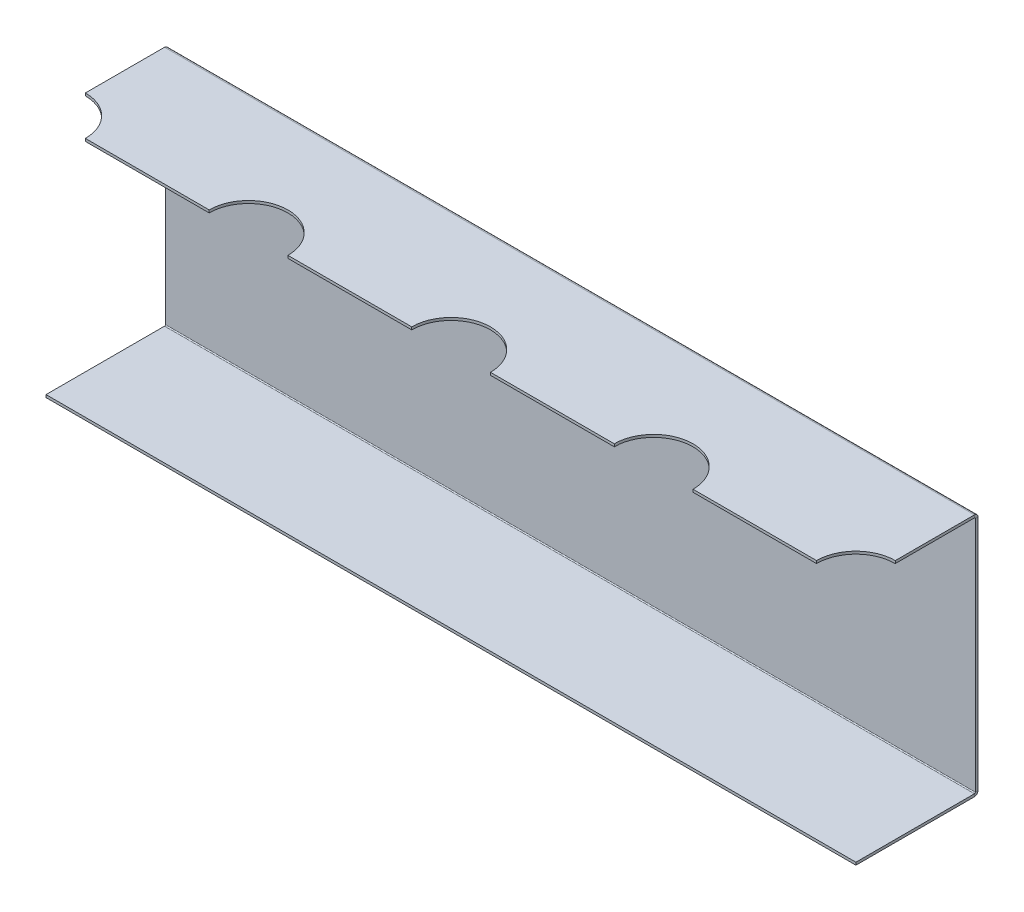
ISO-10303-21;
HEADER;
FILE_DESCRIPTION(('STEP AP214'),'2;1');
FILE_NAME('part.step','',(''),(''),'','','');
FILE_SCHEMA(('AUTOMOTIVE_DESIGN { 1 0 10303 214 1 1 1 1 }'));
ENDSEC;
DATA;
#1=APPLICATION_CONTEXT('core data for automotive mechanical design processes');
#2=APPLICATION_PROTOCOL_DEFINITION('international standard','automotive_design',2000,#1);
#3=PRODUCT_CONTEXT('',#1,'mechanical');
#4=PRODUCT('Part','Part','',(#3));
#5=PRODUCT_RELATED_PRODUCT_CATEGORY('part','',(#4));
#6=PRODUCT_DEFINITION_FORMATION('','',#4);
#7=PRODUCT_DEFINITION_CONTEXT('part definition',#1,'design');
#8=PRODUCT_DEFINITION('design','',#6,#7);
#9=PRODUCT_DEFINITION_SHAPE('','',#8);
#10=(LENGTH_UNIT() NAMED_UNIT(*) SI_UNIT(.MILLI.,.METRE.));
#11=(NAMED_UNIT(*) PLANE_ANGLE_UNIT() SI_UNIT($,.RADIAN.));
#12=(NAMED_UNIT(*) SI_UNIT($,.STERADIAN.) SOLID_ANGLE_UNIT());
#13=UNCERTAINTY_MEASURE_WITH_UNIT(LENGTH_MEASURE(1.E-05),#10,'distance_accuracy_value','');
#14=(GEOMETRIC_REPRESENTATION_CONTEXT(3) GLOBAL_UNCERTAINTY_ASSIGNED_CONTEXT((#13)) GLOBAL_UNIT_ASSIGNED_CONTEXT((#10,
#11,#12)) REPRESENTATION_CONTEXT('',''));
#15=CARTESIAN_POINT('',(0.,0.,0.));
#16=DIRECTION('',(0.,0.,1.));
#17=DIRECTION('',(1.,0.,0.));
#18=AXIS2_PLACEMENT_3D('',#15,#16,#17);
#19=CARTESIAN_POINT('',(308.5,93.0000000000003,93.));
#20=DIRECTION('',(0.,-1.,0.));
#21=DIRECTION('',(0.,0.,-1.));
#22=AXIS2_PLACEMENT_3D('',#19,#20,#21);
#23=PLANE('',#22);
#24=CARTESIAN_POINT('',(-308.5,93.0000000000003,93.));
#25=DIRECTION('',(0.,-1.,0.));
#26=DIRECTION('',(0.,0.,-1.));
#27=AXIS2_PLACEMENT_3D('',#24,#25,#26);
#28=CIRCLE('',#27,30.);
#29=CARTESIAN_POINT('',(-278.5,93.0000000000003,93.));
#30=VERTEX_POINT('',#29);
#31=CARTESIAN_POINT('',(-308.5,93.0000000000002,63.));
#32=VERTEX_POINT('',#31);
#33=EDGE_CURVE('E48',#30,#32,#28,.F.);
#34=ORIENTED_EDGE('',*,*,#33,.F.);
#35=DIRECTION('',(1.,0.,0.));
#36=VECTOR('',#35,1.);
#37=CARTESIAN_POINT('',(308.5,93.0000000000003,93.));
#38=LINE('',#37,#36);
#39=CARTESIAN_POINT('',(-184.2,93.0000000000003,93.));
#40=VERTEX_POINT('',#39);
#41=EDGE_CURVE('E179',#30,#40,#38,.T.);
#42=ORIENTED_EDGE('',*,*,#41,.T.);
#43=CARTESIAN_POINT('',(-154.2,93.0000000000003,93.));
#44=DIRECTION('',(0.,-1.,0.));
#45=DIRECTION('',(0.,0.,-1.));
#46=AXIS2_PLACEMENT_3D('',#43,#44,#45);
#47=CIRCLE('',#46,30.);
#48=CARTESIAN_POINT('',(-124.2,93.0000000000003,93.));
#49=VERTEX_POINT('',#48);
#50=EDGE_CURVE('E282',#49,#40,#47,.F.);
#51=ORIENTED_EDGE('',*,*,#50,.F.);
#52=CARTESIAN_POINT('',(-29.8999999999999,93.0000000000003,93.));
#53=VERTEX_POINT('',#52);
#54=EDGE_CURVE('E190',#49,#53,#38,.T.);
#55=ORIENTED_EDGE('',*,*,#54,.T.);
#56=CARTESIAN_POINT('',(0.100000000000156,93.0000000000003,93.));
#57=DIRECTION('',(0.,-1.,0.));
#58=DIRECTION('',(0.,0.,-1.));
#59=AXIS2_PLACEMENT_3D('',#56,#57,#58);
#60=CIRCLE('',#59,30.);
#61=CARTESIAN_POINT('',(30.1000000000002,93.0000000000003,93.));
#62=VERTEX_POINT('',#61);
#63=EDGE_CURVE('E292',#62,#53,#60,.F.);
#64=ORIENTED_EDGE('',*,*,#63,.F.);
#65=CARTESIAN_POINT('',(124.4,93.0000000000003,93.));
#66=VERTEX_POINT('',#65);
#67=EDGE_CURVE('E197',#62,#66,#38,.T.);
#68=ORIENTED_EDGE('',*,*,#67,.T.);
#69=CARTESIAN_POINT('',(154.4,93.0000000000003,93.));
#70=DIRECTION('',(0.,-1.,0.));
#71=DIRECTION('',(0.,0.,-1.));
#72=AXIS2_PLACEMENT_3D('',#69,#70,#71);
#73=CIRCLE('',#72,30.);
#74=CARTESIAN_POINT('',(184.4,93.0000000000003,93.));
#75=VERTEX_POINT('',#74);
#76=EDGE_CURVE('E302',#75,#66,#73,.F.);
#77=ORIENTED_EDGE('',*,*,#76,.F.);
#78=CARTESIAN_POINT('',(278.5,93.0000000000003,93.));
#79=VERTEX_POINT('',#78);
#80=EDGE_CURVE('E192',#75,#79,#38,.T.);
#81=ORIENTED_EDGE('',*,*,#80,.T.);
#82=CARTESIAN_POINT('',(308.5,93.0000000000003,93.));
#83=DIRECTION('',(0.,-1.,0.));
#84=DIRECTION('',(0.,0.,-1.));
#85=AXIS2_PLACEMENT_3D('',#82,#83,#84);
#86=CIRCLE('',#85,30.);
#87=CARTESIAN_POINT('',(308.5,93.0000000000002,63.));
#88=VERTEX_POINT('',#87);
#89=EDGE_CURVE('E312',#88,#79,#86,.F.);
#90=ORIENTED_EDGE('',*,*,#89,.F.);
#91=DIRECTION('',(0.,0.,-1.));
#92=VECTOR('',#91,1.);
#93=CARTESIAN_POINT('',(308.5,93.,1.99999999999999));
#94=LINE('',#93,#92);
#95=CARTESIAN_POINT('',(308.5,93.,2.73659999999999));
#96=VERTEX_POINT('',#95);
#97=EDGE_CURVE('E205',#88,#96,#94,.T.);
#98=ORIENTED_EDGE('',*,*,#97,.T.);
#99=DIRECTION('',(1.,0.,0.));
#100=VECTOR('',#99,1.);
#101=CARTESIAN_POINT('',(308.5,93.,2.73659999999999));
#102=LINE('',#101,#100);
#103=CARTESIAN_POINT('',(-308.5,93.,2.73659999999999));
#104=VERTEX_POINT('',#103);
#105=EDGE_CURVE('E217',#104,#96,#102,.T.);
#106=ORIENTED_EDGE('',*,*,#105,.F.);
#107=DIRECTION('',(0.,0.,1.));
#108=VECTOR('',#107,1.);
#109=CARTESIAN_POINT('',(-308.5,93.0000000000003,93.));
#110=LINE('',#109,#108);
#111=EDGE_CURVE('E183',#104,#32,#110,.T.);
#112=ORIENTED_EDGE('',*,*,#111,.T.);
#113=EDGE_LOOP('',(#34,#42,#51,#55,#64,#68,#77,#81,#90,#98,#106,#112));
#114=FACE_BOUND('',#113,.T.);
#115=ADVANCED_FACE('F33',(#114),#23,.F.);
#116=CARTESIAN_POINT('',(308.5,91.0000000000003,93.));
#117=DIRECTION('',(0.,-1.,0.));
#118=DIRECTION('',(0.,0.,-1.));
#119=AXIS2_PLACEMENT_3D('',#116,#117,#118);
#120=PLANE('',#119);
#121=DIRECTION('',(1.,0.,0.));
#122=VECTOR('',#121,1.);
#123=CARTESIAN_POINT('',(308.5,91.0000000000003,93.));
#124=LINE('',#123,#122);
#125=CARTESIAN_POINT('',(-278.5,91.0000000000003,93.));
#126=VERTEX_POINT('',#125);
#127=CARTESIAN_POINT('',(-184.2,91.0000000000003,93.));
#128=VERTEX_POINT('',#127);
#129=EDGE_CURVE('E206',#126,#128,#124,.T.);
#130=ORIENTED_EDGE('',*,*,#129,.F.);
#131=CARTESIAN_POINT('',(-308.5,91.0000000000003,93.));
#132=DIRECTION('',(0.,-1.,0.));
#133=DIRECTION('',(0.,0.,-1.));
#134=AXIS2_PLACEMENT_3D('',#131,#132,#133);
#135=CIRCLE('',#134,30.);
#136=CARTESIAN_POINT('',(-308.5,91.0000000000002,63.));
#137=VERTEX_POINT('',#136);
#138=EDGE_CURVE('E170',#126,#137,#135,.F.);
#139=ORIENTED_EDGE('',*,*,#138,.T.);
#140=DIRECTION('',(0.,0.,1.));
#141=VECTOR('',#140,1.);
#142=CARTESIAN_POINT('',(-308.5,91.0000000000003,93.));
#143=LINE('',#142,#141);
#144=CARTESIAN_POINT('',(-308.5,91.,2.7366));
#145=VERTEX_POINT('',#144);
#146=EDGE_CURVE('E212',#145,#137,#143,.T.);
#147=ORIENTED_EDGE('',*,*,#146,.F.);
#148=DIRECTION('',(-1.,0.,0.));
#149=VECTOR('',#148,1.);
#150=CARTESIAN_POINT('',(308.5,91.,2.73660000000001));
#151=LINE('',#150,#149);
#152=CARTESIAN_POINT('',(308.5,91.,2.7366));
#153=VERTEX_POINT('',#152);
#154=EDGE_CURVE('E224',#153,#145,#151,.T.);
#155=ORIENTED_EDGE('',*,*,#154,.F.);
#156=DIRECTION('',(0.,0.,-1.));
#157=VECTOR('',#156,1.);
#158=CARTESIAN_POINT('',(308.5,91.,2.));
#159=LINE('',#158,#157);
#160=CARTESIAN_POINT('',(308.5,91.0000000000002,63.));
#161=VERTEX_POINT('',#160);
#162=EDGE_CURVE('E215',#161,#153,#159,.T.);
#163=ORIENTED_EDGE('',*,*,#162,.F.);
#164=CARTESIAN_POINT('',(308.5,91.0000000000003,93.));
#165=DIRECTION('',(0.,-1.,0.));
#166=DIRECTION('',(0.,0.,-1.));
#167=AXIS2_PLACEMENT_3D('',#164,#165,#166);
#168=CIRCLE('',#167,30.);
#169=CARTESIAN_POINT('',(278.5,91.0000000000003,93.));
#170=VERTEX_POINT('',#169);
#171=EDGE_CURVE('E56',#161,#170,#168,.F.);
#172=ORIENTED_EDGE('',*,*,#171,.T.);
#173=CARTESIAN_POINT('',(184.4,91.0000000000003,93.));
#174=VERTEX_POINT('',#173);
#175=EDGE_CURVE('E211',#174,#170,#124,.T.);
#176=ORIENTED_EDGE('',*,*,#175,.F.);
#177=CARTESIAN_POINT('',(154.4,91.0000000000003,93.));
#178=DIRECTION('',(0.,-1.,0.));
#179=DIRECTION('',(0.,0.,-1.));
#180=AXIS2_PLACEMENT_3D('',#177,#178,#179);
#181=CIRCLE('',#180,30.);
#182=CARTESIAN_POINT('',(124.4,91.0000000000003,93.));
#183=VERTEX_POINT('',#182);
#184=EDGE_CURVE('E304',#174,#183,#181,.F.);
#185=ORIENTED_EDGE('',*,*,#184,.T.);
#186=CARTESIAN_POINT('',(30.1000000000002,91.0000000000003,93.));
#187=VERTEX_POINT('',#186);
#188=EDGE_CURVE('E640',#187,#183,#124,.T.);
#189=ORIENTED_EDGE('',*,*,#188,.F.);
#190=CARTESIAN_POINT('',(0.100000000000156,91.0000000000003,93.));
#191=DIRECTION('',(0.,-1.,0.));
#192=DIRECTION('',(0.,0.,-1.));
#193=AXIS2_PLACEMENT_3D('',#190,#191,#192);
#194=CIRCLE('',#193,30.);
#195=CARTESIAN_POINT('',(-29.8999999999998,91.0000000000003,93.));
#196=VERTEX_POINT('',#195);
#197=EDGE_CURVE('E294',#187,#196,#194,.F.);
#198=ORIENTED_EDGE('',*,*,#197,.T.);
#199=CARTESIAN_POINT('',(-124.2,91.0000000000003,93.));
#200=VERTEX_POINT('',#199);
#201=EDGE_CURVE('E210',#200,#196,#124,.T.);
#202=ORIENTED_EDGE('',*,*,#201,.F.);
#203=CARTESIAN_POINT('',(-154.2,91.0000000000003,93.));
#204=DIRECTION('',(0.,-1.,0.));
#205=DIRECTION('',(0.,0.,-1.));
#206=AXIS2_PLACEMENT_3D('',#203,#204,#205);
#207=CIRCLE('',#206,30.);
#208=EDGE_CURVE('E284',#200,#128,#207,.F.);
#209=ORIENTED_EDGE('',*,*,#208,.T.);
#210=EDGE_LOOP('',(#130,#139,#147,#155,#163,#172,#176,#185,#189,#198,#202,#209));
#211=FACE_BOUND('',#210,.T.);
#212=ADVANCED_FACE('F319',(#211),#120,.T.);
#213=CARTESIAN_POINT('',(308.5,93.0000000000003,93.));
#214=DIRECTION('',(0.,0.,-1.));
#215=DIRECTION('',(0.,1.,0.));
#216=AXIS2_PLACEMENT_3D('',#213,#214,#215);
#217=PLANE('',#216);
#218=DIRECTION('',(0.,-1.,0.));
#219=VECTOR('',#218,1.);
#220=CARTESIAN_POINT('',(-278.5,91.0000000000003,93.));
#221=LINE('',#220,#219);
#222=EDGE_CURVE('E167',#126,#30,#221,.F.);
#223=ORIENTED_EDGE('',*,*,#222,.F.);
#224=ORIENTED_EDGE('',*,*,#129,.T.);
#225=DIRECTION('',(0.,-1.,0.));
#226=VECTOR('',#225,1.);
#227=CARTESIAN_POINT('',(-184.2,91.0000000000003,93.));
#228=LINE('',#227,#226);
#229=EDGE_CURVE('E188',#128,#40,#228,.F.);
#230=ORIENTED_EDGE('',*,*,#229,.T.);
#231=ORIENTED_EDGE('',*,*,#41,.F.);
#232=EDGE_LOOP('',(#223,#224,#230,#231));
#233=FACE_BOUND('',#232,.T.);
#234=ADVANCED_FACE('F186',(#233),#217,.F.);
#235=CARTESIAN_POINT('',(-308.5,93.0000000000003,93.));
#236=DIRECTION('',(1.,0.,0.));
#237=DIRECTION('',(0.,0.,-1.));
#238=AXIS2_PLACEMENT_3D('',#235,#236,#237);
#239=PLANE('',#238);
#240=DIRECTION('',(0.,-1.,0.));
#241=VECTOR('',#240,1.);
#242=CARTESIAN_POINT('',(-308.5,91.0000000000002,63.));
#243=LINE('',#242,#241);
#244=EDGE_CURVE('E174',#137,#32,#243,.F.);
#245=ORIENTED_EDGE('',*,*,#244,.T.);
#246=ORIENTED_EDGE('',*,*,#111,.F.);
#247=DIRECTION('',(0.,1.,0.));
#248=VECTOR('',#247,1.);
#249=CARTESIAN_POINT('',(-308.5,91.,2.73659999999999));
#250=LINE('',#249,#248);
#251=EDGE_CURVE('E220',#145,#104,#250,.T.);
#252=ORIENTED_EDGE('',*,*,#251,.F.);
#253=ORIENTED_EDGE('',*,*,#146,.T.);
#254=EDGE_LOOP('',(#245,#246,#252,#253));
#255=FACE_BOUND('',#254,.T.);
#256=ADVANCED_FACE('F323',(#255),#239,.F.);
#257=DIRECTION('',(0.,-1.,0.));
#258=VECTOR('',#257,1.);
#259=CARTESIAN_POINT('',(278.5,91.0000000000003,93.));
#260=LINE('',#259,#258);
#261=EDGE_CURVE('E309',#170,#79,#260,.F.);
#262=ORIENTED_EDGE('',*,*,#261,.T.);
#263=ORIENTED_EDGE('',*,*,#80,.F.);
#264=DIRECTION('',(0.,-1.,0.));
#265=VECTOR('',#264,1.);
#266=CARTESIAN_POINT('',(184.4,91.0000000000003,93.));
#267=LINE('',#266,#265);
#268=EDGE_CURVE('E297',#174,#75,#267,.F.);
#269=ORIENTED_EDGE('',*,*,#268,.F.);
#270=ORIENTED_EDGE('',*,*,#175,.T.);
#271=EDGE_LOOP('',(#262,#263,#269,#270));
#272=FACE_BOUND('',#271,.T.);
#273=ADVANCED_FACE('F422',(#272),#217,.F.);
#274=CARTESIAN_POINT('',(308.5,93.,1.99999999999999));
#275=DIRECTION('',(-1.,0.,0.));
#276=DIRECTION('',(0.,0.,1.));
#277=AXIS2_PLACEMENT_3D('',#274,#275,#276);
#278=PLANE('',#277);
#279=DIRECTION('',(0.,-1.,0.));
#280=VECTOR('',#279,1.);
#281=CARTESIAN_POINT('',(308.5,91.0000000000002,63.));
#282=LINE('',#281,#280);
#283=EDGE_CURVE('E307',#161,#88,#282,.F.);
#284=ORIENTED_EDGE('',*,*,#283,.F.);
#285=ORIENTED_EDGE('',*,*,#162,.T.);
#286=DIRECTION('',(0.,1.,0.));
#287=VECTOR('',#286,1.);
#288=CARTESIAN_POINT('',(308.5,91.,2.73660000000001));
#289=LINE('',#288,#287);
#290=EDGE_CURVE('E221',#153,#96,#289,.T.);
#291=ORIENTED_EDGE('',*,*,#290,.T.);
#292=ORIENTED_EDGE('',*,*,#97,.F.);
#293=EDGE_LOOP('',(#284,#285,#291,#292));
#294=FACE_BOUND('',#293,.T.);
#295=ADVANCED_FACE('F349',(#294),#278,.F.);
#296=DIRECTION('',(0.,-1.,0.));
#297=VECTOR('',#296,1.);
#298=CARTESIAN_POINT('',(124.4,91.0000000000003,93.));
#299=LINE('',#298,#297);
#300=EDGE_CURVE('E299',#183,#66,#299,.F.);
#301=ORIENTED_EDGE('',*,*,#300,.T.);
#302=ORIENTED_EDGE('',*,*,#67,.F.);
#303=DIRECTION('',(0.,-1.,0.));
#304=VECTOR('',#303,1.);
#305=CARTESIAN_POINT('',(30.1000000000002,91.0000000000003,93.));
#306=LINE('',#305,#304);
#307=EDGE_CURVE('E287',#187,#62,#306,.F.);
#308=ORIENTED_EDGE('',*,*,#307,.F.);
#309=ORIENTED_EDGE('',*,*,#188,.T.);
#310=EDGE_LOOP('',(#301,#302,#308,#309));
#311=FACE_BOUND('',#310,.T.);
#312=ADVANCED_FACE('F431',(#311),#217,.F.);
#313=DIRECTION('',(0.,-1.,0.));
#314=VECTOR('',#313,1.);
#315=CARTESIAN_POINT('',(-29.8999999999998,91.0000000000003,93.));
#316=LINE('',#315,#314);
#317=EDGE_CURVE('E289',#196,#53,#316,.F.);
#318=ORIENTED_EDGE('',*,*,#317,.T.);
#319=ORIENTED_EDGE('',*,*,#54,.F.);
#320=DIRECTION('',(0.,-1.,0.));
#321=VECTOR('',#320,1.);
#322=CARTESIAN_POINT('',(-124.2,91.0000000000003,93.));
#323=LINE('',#322,#321);
#324=EDGE_CURVE('E277',#200,#49,#323,.F.);
#325=ORIENTED_EDGE('',*,*,#324,.F.);
#326=ORIENTED_EDGE('',*,*,#201,.T.);
#327=EDGE_LOOP('',(#318,#319,#325,#326));
#328=FACE_BOUND('',#327,.T.);
#329=ADVANCED_FACE('F426',(#328),#217,.F.);
#330=CARTESIAN_POINT('',(-308.5,91.,2.));
#331=DIRECTION('',(1.,0.,0.));
#332=DIRECTION('',(0.,0.,-1.));
#333=AXIS2_PLACEMENT_3D('',#330,#331,#332);
#334=PLANE('',#333);
#335=DIRECTION('',(0.,0.,-1.));
#336=VECTOR('',#335,1.);
#337=CARTESIAN_POINT('',(-308.5,-90.2634,2.00000000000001));
#338=LINE('',#337,#336);
#339=CARTESIAN_POINT('',(-308.5,-90.2634,2.));
#340=VERTEX_POINT('',#339);
#341=CARTESIAN_POINT('',(-308.5,-90.2634,0.));
#342=VERTEX_POINT('',#341);
#343=EDGE_CURVE('E225',#340,#342,#338,.T.);
#344=ORIENTED_EDGE('',*,*,#343,.F.);
#345=DIRECTION('',(0.,-1.,0.));
#346=VECTOR('',#345,1.);
#347=CARTESIAN_POINT('',(-308.5,91.,2.));
#348=LINE('',#347,#346);
#349=CARTESIAN_POINT('',(-308.5,90.2634,2.));
#350=VERTEX_POINT('',#349);
#351=EDGE_CURVE('E41',#350,#340,#348,.T.);
#352=ORIENTED_EDGE('',*,*,#351,.F.);
#353=DIRECTION('',(0.,0.,-1.));
#354=VECTOR('',#353,1.);
#355=CARTESIAN_POINT('',(-308.5,90.2634,2.));
#356=LINE('',#355,#354);
#357=CARTESIAN_POINT('',(-308.5,90.2634,0.));
#358=VERTEX_POINT('',#357);
#359=EDGE_CURVE('E345',#350,#358,#356,.T.);
#360=ORIENTED_EDGE('',*,*,#359,.T.);
#361=DIRECTION('',(0.,-1.,0.));
#362=VECTOR('',#361,1.);
#363=CARTESIAN_POINT('',(-308.5,91.,0.));
#364=LINE('',#363,#362);
#365=EDGE_CURVE('E363',#358,#342,#364,.T.);
#366=ORIENTED_EDGE('',*,*,#365,.T.);
#367=EDGE_LOOP('',(#344,#352,#360,#366));
#368=FACE_BOUND('',#367,.T.);
#369=ADVANCED_FACE('F35',(#368),#334,.F.);
#370=CARTESIAN_POINT('',(308.5,91.,2.));
#371=DIRECTION('',(-1.,0.,0.));
#372=DIRECTION('',(0.,0.,1.));
#373=AXIS2_PLACEMENT_3D('',#370,#371,#372);
#374=PLANE('',#373);
#375=DIRECTION('',(0.,0.,-1.));
#376=VECTOR('',#375,1.);
#377=CARTESIAN_POINT('',(308.5,-90.2634,2.00000000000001));
#378=LINE('',#377,#376);
#379=CARTESIAN_POINT('',(308.5,-90.2634,2.));
#380=VERTEX_POINT('',#379);
#381=CARTESIAN_POINT('',(308.5,-90.2634,0.));
#382=VERTEX_POINT('',#381);
#383=EDGE_CURVE('E229',#380,#382,#378,.T.);
#384=ORIENTED_EDGE('',*,*,#383,.T.);
#385=DIRECTION('',(0.,1.,0.));
#386=VECTOR('',#385,1.);
#387=CARTESIAN_POINT('',(308.5,91.,0.));
#388=LINE('',#387,#386);
#389=CARTESIAN_POINT('',(308.5,90.2634,0.));
#390=VERTEX_POINT('',#389);
#391=EDGE_CURVE('E367',#382,#390,#388,.T.);
#392=ORIENTED_EDGE('',*,*,#391,.T.);
#393=DIRECTION('',(0.,0.,-1.));
#394=VECTOR('',#393,1.);
#395=CARTESIAN_POINT('',(308.5,90.2634,2.));
#396=LINE('',#395,#394);
#397=CARTESIAN_POINT('',(308.5,90.2634,2.));
#398=VERTEX_POINT('',#397);
#399=EDGE_CURVE('E344',#398,#390,#396,.T.);
#400=ORIENTED_EDGE('',*,*,#399,.F.);
#401=DIRECTION('',(0.,1.,0.));
#402=VECTOR('',#401,1.);
#403=CARTESIAN_POINT('',(308.5,91.,2.));
#404=LINE('',#403,#402);
#405=EDGE_CURVE('E11',#380,#398,#404,.T.);
#406=ORIENTED_EDGE('',*,*,#405,.F.);
#407=EDGE_LOOP('',(#384,#392,#400,#406));
#408=FACE_BOUND('',#407,.T.);
#409=ADVANCED_FACE('F445',(#408),#374,.F.);
#410=CARTESIAN_POINT('',(-308.5,-91.,2.));
#411=DIRECTION('',(0.,0.,1.));
#412=DIRECTION('',(1.,0.,0.));
#413=AXIS2_PLACEMENT_3D('',#410,#411,#412);
#414=PLANE('',#413);
#415=ORIENTED_EDGE('',*,*,#351,.T.);
#416=DIRECTION('',(1.,0.,0.));
#417=VECTOR('',#416,1.);
#418=CARTESIAN_POINT('',(308.5,-90.2634,2.00000000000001));
#419=LINE('',#418,#417);
#420=EDGE_CURVE('E245',#380,#340,#419,.F.);
#421=ORIENTED_EDGE('',*,*,#420,.F.);
#422=ORIENTED_EDGE('',*,*,#405,.T.);
#423=DIRECTION('',(-1.,0.,0.));
#424=VECTOR('',#423,1.);
#425=CARTESIAN_POINT('',(-308.5,90.2634,2.));
#426=LINE('',#425,#424);
#427=EDGE_CURVE('E194',#350,#398,#426,.F.);
#428=ORIENTED_EDGE('',*,*,#427,.F.);
#429=EDGE_LOOP('',(#415,#421,#422,#428));
#430=FACE_BOUND('',#429,.T.);
#431=ADVANCED_FACE('F371',(#430),#414,.T.);
#432=CARTESIAN_POINT('',(-308.5,-91.,0.));
#433=DIRECTION('',(0.,0.,1.));
#434=DIRECTION('',(1.,0.,0.));
#435=AXIS2_PLACEMENT_3D('',#432,#433,#434);
#436=PLANE('',#435);
#437=DIRECTION('',(1.,0.,0.));
#438=VECTOR('',#437,1.);
#439=CARTESIAN_POINT('',(308.5,-90.2634,0.));
#440=LINE('',#439,#438);
#441=EDGE_CURVE('E237',#382,#342,#440,.F.);
#442=ORIENTED_EDGE('',*,*,#441,.T.);
#443=ORIENTED_EDGE('',*,*,#365,.F.);
#444=DIRECTION('',(-1.,0.,0.));
#445=VECTOR('',#444,1.);
#446=CARTESIAN_POINT('',(-308.5,90.2634,0.));
#447=LINE('',#446,#445);
#448=EDGE_CURVE('E346',#358,#390,#447,.F.);
#449=ORIENTED_EDGE('',*,*,#448,.T.);
#450=ORIENTED_EDGE('',*,*,#391,.F.);
#451=EDGE_LOOP('',(#442,#443,#449,#450));
#452=FACE_BOUND('',#451,.T.);
#453=ADVANCED_FACE('F438',(#452),#436,.F.);
#454=CARTESIAN_POINT('',(308.5,90.2634,2.7366));
#455=DIRECTION('',(1.,0.,0.));
#456=DIRECTION('',(0.,0.,-1.));
#457=AXIS2_PLACEMENT_3D('',#454,#455,#456);
#458=PLANE('',#457);
#459=ORIENTED_EDGE('',*,*,#290,.F.);
#460=CARTESIAN_POINT('',(308.5,90.2634,2.7366));
#461=DIRECTION('',(-1.,0.,0.));
#462=DIRECTION('',(0.,0.,1.));
#463=AXIS2_PLACEMENT_3D('',#460,#461,#462);
#464=CIRCLE('',#463,0.736600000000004);
#465=EDGE_CURVE('E356',#398,#153,#464,.F.);
#466=ORIENTED_EDGE('',*,*,#465,.F.);
#467=ORIENTED_EDGE('',*,*,#399,.T.);
#468=CARTESIAN_POINT('',(308.5,90.2634,2.7366));
#469=DIRECTION('',(-1.,0.,0.));
#470=DIRECTION('',(0.,0.,1.));
#471=AXIS2_PLACEMENT_3D('',#468,#469,#470);
#472=CIRCLE('',#471,2.7366);
#473=EDGE_CURVE('E336',#390,#96,#472,.F.);
#474=ORIENTED_EDGE('',*,*,#473,.T.);
#475=EDGE_LOOP('',(#459,#466,#467,#474));
#476=FACE_BOUND('',#475,.T.);
#477=ADVANCED_FACE('F340',(#476),#458,.T.);
#478=CARTESIAN_POINT('',(-308.5,90.2634,2.7366));
#479=DIRECTION('',(1.,0.,0.));
#480=DIRECTION('',(0.,0.,-1.));
#481=AXIS2_PLACEMENT_3D('',#478,#479,#480);
#482=PLANE('',#481);
#483=CARTESIAN_POINT('',(-308.5,90.2634,2.7366));
#484=DIRECTION('',(-1.,0.,0.));
#485=DIRECTION('',(0.,0.,1.));
#486=AXIS2_PLACEMENT_3D('',#483,#484,#485);
#487=CIRCLE('',#486,0.736600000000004);
#488=EDGE_CURVE('E189',#145,#350,#487,.T.);
#489=ORIENTED_EDGE('',*,*,#488,.F.);
#490=ORIENTED_EDGE('',*,*,#251,.T.);
#491=CARTESIAN_POINT('',(-308.5,90.2634,2.7366));
#492=DIRECTION('',(-1.,0.,0.));
#493=DIRECTION('',(0.,0.,1.));
#494=AXIS2_PLACEMENT_3D('',#491,#492,#493);
#495=CIRCLE('',#494,2.7366);
#496=EDGE_CURVE('E329',#104,#358,#495,.T.);
#497=ORIENTED_EDGE('',*,*,#496,.T.);
#498=ORIENTED_EDGE('',*,*,#359,.F.);
#499=EDGE_LOOP('',(#489,#490,#497,#498));
#500=FACE_BOUND('',#499,.T.);
#501=ADVANCED_FACE('F327',(#500),#482,.F.);
#502=CARTESIAN_POINT('',(-308.5,90.2634,2.7366));
#503=DIRECTION('',(-1.,0.,0.));
#504=DIRECTION('',(0.,1.,0.));
#505=AXIS2_PLACEMENT_3D('',#502,#503,#504);
#506=CYLINDRICAL_SURFACE('',#505,2.7366);
#507=ORIENTED_EDGE('',*,*,#448,.F.);
#508=ORIENTED_EDGE('',*,*,#496,.F.);
#509=ORIENTED_EDGE('',*,*,#105,.T.);
#510=ORIENTED_EDGE('',*,*,#473,.F.);
#511=EDGE_LOOP('',(#507,#508,#509,#510));
#512=FACE_BOUND('',#511,.T.);
#513=ADVANCED_FACE('F335',(#512),#506,.T.);
#514=CARTESIAN_POINT('',(-308.5,90.2634,2.7366));
#515=DIRECTION('',(-1.,0.,0.));
#516=DIRECTION('',(0.,1.,0.));
#517=AXIS2_PLACEMENT_3D('',#514,#515,#516);
#518=CYLINDRICAL_SURFACE('',#517,0.736600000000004);
#519=ORIENTED_EDGE('',*,*,#427,.T.);
#520=ORIENTED_EDGE('',*,*,#465,.T.);
#521=ORIENTED_EDGE('',*,*,#154,.T.);
#522=ORIENTED_EDGE('',*,*,#488,.T.);
#523=EDGE_LOOP('',(#519,#520,#521,#522));
#524=FACE_BOUND('',#523,.T.);
#525=ADVANCED_FACE('F355',(#524),#518,.F.);
#526=CARTESIAN_POINT('',(-308.5,-90.2634,2.73660000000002));
#527=DIRECTION('',(-1.,0.,0.));
#528=DIRECTION('',(0.,0.,1.));
#529=AXIS2_PLACEMENT_3D('',#526,#527,#528);
#530=PLANE('',#529);
#531=DIRECTION('',(0.,-1.,0.));
#532=VECTOR('',#531,1.);
#533=CARTESIAN_POINT('',(-308.5,-91.,2.73660000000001));
#534=LINE('',#533,#532);
#535=CARTESIAN_POINT('',(-308.5,-91.,2.73660000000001));
#536=VERTEX_POINT('',#535);
#537=CARTESIAN_POINT('',(-308.5,-93.,2.73660000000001));
#538=VERTEX_POINT('',#537);
#539=EDGE_CURVE('E273',#536,#538,#534,.T.);
#540=ORIENTED_EDGE('',*,*,#539,.F.);
#541=CARTESIAN_POINT('',(-308.5,-90.2634,2.73660000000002));
#542=DIRECTION('',(1.,0.,0.));
#543=DIRECTION('',(0.,0.,-1.));
#544=AXIS2_PLACEMENT_3D('',#541,#542,#543);
#545=CIRCLE('',#544,0.736600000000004);
#546=EDGE_CURVE('E238',#340,#536,#545,.F.);
#547=ORIENTED_EDGE('',*,*,#546,.F.);
#548=ORIENTED_EDGE('',*,*,#343,.T.);
#549=CARTESIAN_POINT('',(-308.5,-90.2634,2.73660000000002));
#550=DIRECTION('',(1.,0.,0.));
#551=DIRECTION('',(0.,0.,-1.));
#552=AXIS2_PLACEMENT_3D('',#549,#550,#551);
#553=CIRCLE('',#552,2.7366);
#554=EDGE_CURVE('E231',#342,#538,#553,.F.);
#555=ORIENTED_EDGE('',*,*,#554,.T.);
#556=EDGE_LOOP('',(#540,#547,#548,#555));
#557=FACE_BOUND('',#556,.T.);
#558=ADVANCED_FACE('F380',(#557),#530,.T.);
#559=CARTESIAN_POINT('',(308.5,-90.2634,2.73660000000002));
#560=DIRECTION('',(-1.,0.,0.));
#561=DIRECTION('',(0.,0.,1.));
#562=AXIS2_PLACEMENT_3D('',#559,#560,#561);
#563=PLANE('',#562);
#564=CARTESIAN_POINT('',(308.5,-90.2634,2.73660000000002));
#565=DIRECTION('',(1.,0.,0.));
#566=DIRECTION('',(0.,0.,-1.));
#567=AXIS2_PLACEMENT_3D('',#564,#565,#566);
#568=CIRCLE('',#567,0.736600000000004);
#569=CARTESIAN_POINT('',(308.5,-91.,2.73660000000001));
#570=VERTEX_POINT('',#569);
#571=EDGE_CURVE('E242',#570,#380,#568,.T.);
#572=ORIENTED_EDGE('',*,*,#571,.F.);
#573=DIRECTION('',(0.,-1.,0.));
#574=VECTOR('',#573,1.);
#575=CARTESIAN_POINT('',(308.5,-91.,2.73660000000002));
#576=LINE('',#575,#574);
#577=CARTESIAN_POINT('',(308.5,-93.,2.73660000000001));
#578=VERTEX_POINT('',#577);
#579=EDGE_CURVE('E272',#570,#578,#576,.T.);
#580=ORIENTED_EDGE('',*,*,#579,.T.);
#581=CARTESIAN_POINT('',(308.5,-90.2634,2.73660000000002));
#582=DIRECTION('',(1.,0.,0.));
#583=DIRECTION('',(0.,0.,-1.));
#584=AXIS2_PLACEMENT_3D('',#581,#582,#583);
#585=CIRCLE('',#584,2.7366);
#586=EDGE_CURVE('E234',#578,#382,#585,.T.);
#587=ORIENTED_EDGE('',*,*,#586,.T.);
#588=ORIENTED_EDGE('',*,*,#383,.F.);
#589=EDGE_LOOP('',(#572,#580,#587,#588));
#590=FACE_BOUND('',#589,.T.);
#591=ADVANCED_FACE('F402',(#590),#563,.F.);
#592=CARTESIAN_POINT('',(308.5,-90.2634,2.73660000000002));
#593=DIRECTION('',(1.,0.,0.));
#594=DIRECTION('',(0.,-1.,0.));
#595=AXIS2_PLACEMENT_3D('',#592,#593,#594);
#596=CYLINDRICAL_SURFACE('',#595,2.7366);
#597=ORIENTED_EDGE('',*,*,#441,.F.);
#598=ORIENTED_EDGE('',*,*,#586,.F.);
#599=DIRECTION('',(-1.,0.,0.));
#600=VECTOR('',#599,1.);
#601=CARTESIAN_POINT('',(-308.5,-93.,2.73659999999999));
#602=LINE('',#601,#600);
#603=EDGE_CURVE('E270',#578,#538,#602,.T.);
#604=ORIENTED_EDGE('',*,*,#603,.T.);
#605=ORIENTED_EDGE('',*,*,#554,.F.);
#606=EDGE_LOOP('',(#597,#598,#604,#605));
#607=FACE_BOUND('',#606,.T.);
#608=ADVANCED_FACE('F455',(#607),#596,.T.);
#609=CARTESIAN_POINT('',(308.5,-90.2634,2.73660000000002));
#610=DIRECTION('',(1.,0.,0.));
#611=DIRECTION('',(0.,-1.,0.));
#612=AXIS2_PLACEMENT_3D('',#609,#610,#611);
#613=CYLINDRICAL_SURFACE('',#612,0.736600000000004);
#614=ORIENTED_EDGE('',*,*,#420,.T.);
#615=ORIENTED_EDGE('',*,*,#546,.T.);
#616=DIRECTION('',(1.,0.,0.));
#617=VECTOR('',#616,1.);
#618=CARTESIAN_POINT('',(-308.5,-91.,2.73660000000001));
#619=LINE('',#618,#617);
#620=EDGE_CURVE('E276',#536,#570,#619,.T.);
#621=ORIENTED_EDGE('',*,*,#620,.T.);
#622=ORIENTED_EDGE('',*,*,#571,.T.);
#623=EDGE_LOOP('',(#614,#615,#621,#622));
#624=FACE_BOUND('',#623,.T.);
#625=ADVANCED_FACE('F376',(#624),#613,.F.);
#626=CARTESIAN_POINT('',(-308.5,-93.,1.99999999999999));
#627=DIRECTION('',(1.,0.,0.));
#628=DIRECTION('',(0.,0.,-1.));
#629=AXIS2_PLACEMENT_3D('',#626,#627,#628);
#630=PLANE('',#629);
#631=ORIENTED_EDGE('',*,*,#539,.T.);
#632=DIRECTION('',(0.,0.,-1.));
#633=VECTOR('',#632,1.);
#634=CARTESIAN_POINT('',(-308.5,-93.,1.99999999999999));
#635=LINE('',#634,#633);
#636=CARTESIAN_POINT('',(-308.5,-93.0000000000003,93.));
#637=VERTEX_POINT('',#636);
#638=EDGE_CURVE('E260',#637,#538,#635,.T.);
#639=ORIENTED_EDGE('',*,*,#638,.F.);
#640=DIRECTION('',(0.,1.,0.));
#641=VECTOR('',#640,1.);
#642=CARTESIAN_POINT('',(-308.5,-93.0000000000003,93.));
#643=LINE('',#642,#641);
#644=CARTESIAN_POINT('',(-308.5,-91.0000000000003,93.));
#645=VERTEX_POINT('',#644);
#646=EDGE_CURVE('E253',#637,#645,#643,.T.);
#647=ORIENTED_EDGE('',*,*,#646,.T.);
#648=DIRECTION('',(0.,0.,-1.));
#649=VECTOR('',#648,1.);
#650=CARTESIAN_POINT('',(-308.5,-91.,2.));
#651=LINE('',#650,#649);
#652=EDGE_CURVE('E267',#645,#536,#651,.T.);
#653=ORIENTED_EDGE('',*,*,#652,.T.);
#654=EDGE_LOOP('',(#631,#639,#647,#653));
#655=FACE_BOUND('',#654,.T.);
#656=ADVANCED_FACE('F384',(#655),#630,.F.);
#657=CARTESIAN_POINT('',(308.5,-93.0000000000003,93.));
#658=DIRECTION('',(-1.,0.,0.));
#659=DIRECTION('',(0.,0.,1.));
#660=AXIS2_PLACEMENT_3D('',#657,#658,#659);
#661=PLANE('',#660);
#662=ORIENTED_EDGE('',*,*,#579,.F.);
#663=DIRECTION('',(0.,0.,1.));
#664=VECTOR('',#663,1.);
#665=CARTESIAN_POINT('',(308.5,-91.0000000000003,93.));
#666=LINE('',#665,#664);
#667=CARTESIAN_POINT('',(308.5,-91.0000000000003,93.));
#668=VERTEX_POINT('',#667);
#669=EDGE_CURVE('E265',#570,#668,#666,.T.);
#670=ORIENTED_EDGE('',*,*,#669,.T.);
#671=DIRECTION('',(0.,1.,0.));
#672=VECTOR('',#671,1.);
#673=CARTESIAN_POINT('',(308.5,-93.0000000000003,93.));
#674=LINE('',#673,#672);
#675=CARTESIAN_POINT('',(308.5,-93.0000000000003,93.));
#676=VERTEX_POINT('',#675);
#677=EDGE_CURVE('E246',#676,#668,#674,.T.);
#678=ORIENTED_EDGE('',*,*,#677,.F.);
#679=DIRECTION('',(0.,0.,1.));
#680=VECTOR('',#679,1.);
#681=CARTESIAN_POINT('',(308.5,-93.0000000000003,93.));
#682=LINE('',#681,#680);
#683=EDGE_CURVE('E258',#578,#676,#682,.T.);
#684=ORIENTED_EDGE('',*,*,#683,.F.);
#685=EDGE_LOOP('',(#662,#670,#678,#684));
#686=FACE_BOUND('',#685,.T.);
#687=ADVANCED_FACE('F404',(#686),#661,.F.);
#688=CARTESIAN_POINT('',(-308.5,-93.0000000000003,93.));
#689=DIRECTION('',(0.,1.,0.));
#690=DIRECTION('',(0.,0.,1.));
#691=AXIS2_PLACEMENT_3D('',#688,#689,#690);
#692=PLANE('',#691);
#693=ORIENTED_EDGE('',*,*,#603,.F.);
#694=ORIENTED_EDGE('',*,*,#683,.T.);
#695=DIRECTION('',(-1.,0.,0.));
#696=VECTOR('',#695,1.);
#697=CARTESIAN_POINT('',(-308.5,-93.0000000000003,93.));
#698=LINE('',#697,#696);
#699=EDGE_CURVE('E256',#676,#637,#698,.T.);
#700=ORIENTED_EDGE('',*,*,#699,.T.);
#701=ORIENTED_EDGE('',*,*,#638,.T.);
#702=EDGE_LOOP('',(#693,#694,#700,#701));
#703=FACE_BOUND('',#702,.T.);
#704=ADVANCED_FACE('F388',(#703),#692,.F.);
#705=CARTESIAN_POINT('',(-308.5,-91.0000000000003,93.));
#706=DIRECTION('',(0.,1.,0.));
#707=DIRECTION('',(0.,0.,1.));
#708=AXIS2_PLACEMENT_3D('',#705,#706,#707);
#709=PLANE('',#708);
#710=ORIENTED_EDGE('',*,*,#669,.F.);
#711=ORIENTED_EDGE('',*,*,#620,.F.);
#712=ORIENTED_EDGE('',*,*,#652,.F.);
#713=DIRECTION('',(-1.,0.,0.));
#714=VECTOR('',#713,1.);
#715=CARTESIAN_POINT('',(-308.5,-91.0000000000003,93.));
#716=LINE('',#715,#714);
#717=EDGE_CURVE('E263',#668,#645,#716,.T.);
#718=ORIENTED_EDGE('',*,*,#717,.F.);
#719=EDGE_LOOP('',(#710,#711,#712,#718));
#720=FACE_BOUND('',#719,.T.);
#721=ADVANCED_FACE('F398',(#720),#709,.T.);
#722=CARTESIAN_POINT('',(-308.5,-93.0000000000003,93.));
#723=DIRECTION('',(0.,0.,-1.));
#724=DIRECTION('',(0.,1.,0.));
#725=AXIS2_PLACEMENT_3D('',#722,#723,#724);
#726=PLANE('',#725);
#727=ORIENTED_EDGE('',*,*,#717,.T.);
#728=ORIENTED_EDGE('',*,*,#646,.F.);
#729=ORIENTED_EDGE('',*,*,#699,.F.);
#730=ORIENTED_EDGE('',*,*,#677,.T.);
#731=EDGE_LOOP('',(#727,#728,#729,#730));
#732=FACE_BOUND('',#731,.T.);
#733=ADVANCED_FACE('F394',(#732),#726,.F.);
#734=CARTESIAN_POINT('',(-154.2,91.0000000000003,93.));
#735=DIRECTION('',(0.,-1.,0.));
#736=DIRECTION('',(0.,0.,-1.));
#737=AXIS2_PLACEMENT_3D('',#734,#735,#736);
#738=CYLINDRICAL_SURFACE('',#737,30.);
#739=ORIENTED_EDGE('',*,*,#208,.F.);
#740=ORIENTED_EDGE('',*,*,#324,.T.);
#741=ORIENTED_EDGE('',*,*,#50,.T.);
#742=ORIENTED_EDGE('',*,*,#229,.F.);
#743=EDGE_LOOP('',(#739,#740,#741,#742));
#744=FACE_BOUND('',#743,.T.);
#745=ADVANCED_FACE('F522',(#744),#738,.F.);
#746=CARTESIAN_POINT('',(0.100000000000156,91.0000000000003,93.));
#747=DIRECTION('',(0.,-1.,0.));
#748=DIRECTION('',(0.,0.,-1.));
#749=AXIS2_PLACEMENT_3D('',#746,#747,#748);
#750=CYLINDRICAL_SURFACE('',#749,30.);
#751=ORIENTED_EDGE('',*,*,#197,.F.);
#752=ORIENTED_EDGE('',*,*,#307,.T.);
#753=ORIENTED_EDGE('',*,*,#63,.T.);
#754=ORIENTED_EDGE('',*,*,#317,.F.);
#755=EDGE_LOOP('',(#751,#752,#753,#754));
#756=FACE_BOUND('',#755,.T.);
#757=ADVANCED_FACE('F587',(#756),#750,.F.);
#758=CARTESIAN_POINT('',(154.4,91.0000000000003,93.));
#759=DIRECTION('',(0.,-1.,0.));
#760=DIRECTION('',(0.,0.,-1.));
#761=AXIS2_PLACEMENT_3D('',#758,#759,#760);
#762=CYLINDRICAL_SURFACE('',#761,30.);
#763=ORIENTED_EDGE('',*,*,#184,.F.);
#764=ORIENTED_EDGE('',*,*,#268,.T.);
#765=ORIENTED_EDGE('',*,*,#76,.T.);
#766=ORIENTED_EDGE('',*,*,#300,.F.);
#767=EDGE_LOOP('',(#763,#764,#765,#766));
#768=FACE_BOUND('',#767,.T.);
#769=ADVANCED_FACE('F597',(#768),#762,.F.);
#770=CARTESIAN_POINT('',(308.5,91.0000000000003,93.));
#771=DIRECTION('',(0.,-1.,0.));
#772=DIRECTION('',(0.,0.,-1.));
#773=AXIS2_PLACEMENT_3D('',#770,#771,#772);
#774=CYLINDRICAL_SURFACE('',#773,30.);
#775=ORIENTED_EDGE('',*,*,#171,.F.);
#776=ORIENTED_EDGE('',*,*,#283,.T.);
#777=ORIENTED_EDGE('',*,*,#89,.T.);
#778=ORIENTED_EDGE('',*,*,#261,.F.);
#779=EDGE_LOOP('',(#775,#776,#777,#778));
#780=FACE_BOUND('',#779,.T.);
#781=ADVANCED_FACE('F608',(#780),#774,.F.);
#782=CARTESIAN_POINT('',(-308.5,91.0000000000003,93.));
#783=DIRECTION('',(0.,-1.,0.));
#784=DIRECTION('',(0.,0.,-1.));
#785=AXIS2_PLACEMENT_3D('',#782,#783,#784);
#786=CYLINDRICAL_SURFACE('',#785,30.);
#787=ORIENTED_EDGE('',*,*,#138,.F.);
#788=ORIENTED_EDGE('',*,*,#222,.T.);
#789=ORIENTED_EDGE('',*,*,#33,.T.);
#790=ORIENTED_EDGE('',*,*,#244,.F.);
#791=EDGE_LOOP('',(#787,#788,#789,#790));
#792=FACE_BOUND('',#791,.T.);
#793=ADVANCED_FACE('F168',(#792),#786,.F.);
#794=CLOSED_SHELL('',(#115,#212,#234,#256,#273,#295,#312,#329,#369,#409,#431,#453,#477,#501,
#513,#525,#558,#591,#608,#625,#656,#687,#704,#721,#733,#745,#757,#769,#781,#793));
#795=MANIFOLD_SOLID_BREP('B2',#794);
#796=ADVANCED_BREP_SHAPE_REPRESENTATION('',(#18,#795),#14);
#797=SHAPE_DEFINITION_REPRESENTATION(#9,#796);
ENDSEC;
END-ISO-10303-21;
